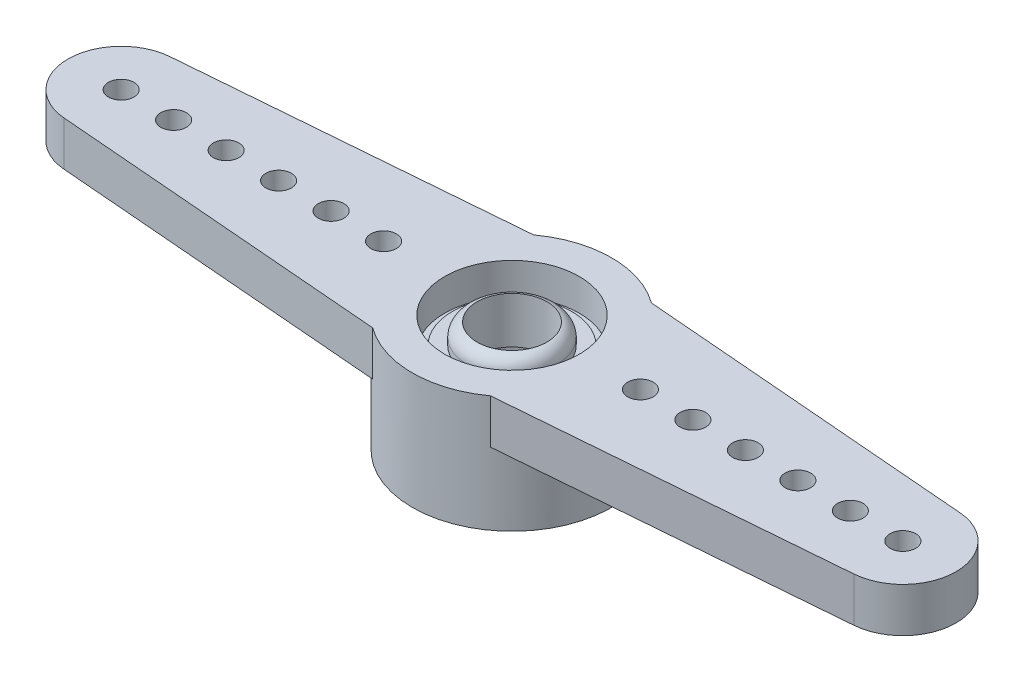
from build123d import *

# Parameters (mm, degrees)
EXTRUDE17_DEPTH = 1.6129
EXTRUDE19_START = -4.2291
SKETCH19_R      = 3.6195
EXTRUDE19_DEPTH = 4.2291
SKETCH20_R      = 0.46355
SKETCH20_R_2    = 1.27
EXTRUDE20_DEPTH = 18.050548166
SKETCH21_R      = 2.44475
EXTRUDE21_DEPTH = 1.1557
SKETCH22_R      = 2.286
EXTRUDE22_DEPTH = 2.3368
SKETCH23_R      = 2.159
EXTRUDE23_DEPTH = 0.2032
SKETCH24_R      = 1.651
EXTRUDE24_DEPTH = 0.762
EXTRUDE25_DEPTH = 0.508
FILLET1_R       = 0.508


with BuildPart() as part:
    # Sketch18 → Extrude17 (new body)
    with BuildSketch(Plane(origin=(0, 0, 0), x_dir=(1, 0, 0), z_dir=(0, 1, 0))):
        with BuildLine():
            Line((-14.34305969, 1.923991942), (-2.13741415, 2.921))
            ThreePointArc((-2.13741415, 2.921), (0, 3.6195), (2.13741415, 2.921))
            Line((2.13741415, 2.921), (14.34305969, 1.923991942))
            ThreePointArc((14.34305969, 1.923991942), (16.1163, 0), (14.34305969, -1.923991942))
            Line((14.34305969, -1.923991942), (2.13741415, -2.921))
            ThreePointArc((2.13741415, -2.921), (0, -3.6195), (-2.13741415, -2.921))
            Line((-2.13741415, -2.921), (-14.34305969, -1.923991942))
            ThreePointArc((-14.34305969, -1.923991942), (-16.1163, 0), (-14.34305969, 1.923991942))
        make_face()
    extrude(amount=EXTRUDE17_DEPTH)

    # Sketch19 → Extrude19 (add)
    with BuildSketch(Plane(origin=(0, 1.6129, 0), x_dir=(1, 0, 0), z_dir=(0, 1, 0)).offset(EXTRUDE19_START)):
        with Locations(Location((0, 0, 0), (0, 0, 126.194447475))):
            Circle(SKETCH19_R)
    extrude(amount=EXTRUDE19_DEPTH)

    # Sketch20 → Extrude20 (cut, through all)
    with BuildSketch(Plane(origin=(0, 1.6129, 0), x_dir=(1, 0, 0), z_dir=(0, 1, 0))):
        with Locations(Location((-14.1859, 0, 0), (0, 0, 270))):
            Circle(SKETCH20_R)
        with Locations(Location((0, 0, 0), (0, 0, 270))):
            Circle(SKETCH20_R_2)
        with Locations(Location((-4.6609, 0, 0), (0, 0, 270))):
            Circle(SKETCH20_R)
        with Locations(Location((-6.5659, 0, 0), (0, 0, 270))):
            Circle(SKETCH20_R)
        with Locations(Location((-8.4709, 0, 0), (0, 0, 270))):
            Circle(SKETCH20_R)
        with Locations(Location((-10.3759, 0, 0), (0, 0, 270))):
            Circle(SKETCH20_R)
        with Locations(Location((-12.2809, 0, 0), (0, 0, 270))):
            Circle(SKETCH20_R)
    extrude20 = extrude(amount=-EXTRUDE20_DEPTH, mode=Mode.SUBTRACT)

    # Sketch21 → Extrude21 (cut)
    with BuildSketch(Plane(origin=(0, 1.6129, 0), x_dir=(1, 0, 0), z_dir=(0, 1, 0))):
        with Locations(Location((0, 0, 0), (0, 0, 270))):
            Circle(SKETCH21_R)
    extrude(amount=-EXTRUDE21_DEPTH, mode=Mode.SUBTRACT)

    # Sketch22 → Extrude22 (cut)
    with BuildSketch(Plane.XZ.offset(2.6162)):
        with Locations(Location((0, 0, 0), (0, 0, 270))):
            Circle(SKETCH22_R)
    extrude(amount=-EXTRUDE22_DEPTH, mode=Mode.SUBTRACT)



with BuildPart() as body_2:
    # Sketch23 → Extrude23 (new body)
    with BuildSketch(Plane(origin=(0, 0.4572, 0), x_dir=(1, 0, 0), z_dir=(0, 1, 0))):
        with Locations(Location((0, 0, 0), (0, 0, 270))):
            Circle(SKETCH23_R)
    extrude(amount=EXTRUDE23_DEPTH)


with BuildPart() as part_1:
    add(part.part)

    add(body_2.part)  # Extrude24 merges body 2
    # Sketch24 → Extrude24 (add)
    with BuildSketch(Plane(origin=(0, 0.6604, 0), x_dir=(1, 0, 0), z_dir=(0, 1, 0))):
        with Locations(Location((0, 0, 0), (0, 0, 90))):
            Circle(SKETCH24_R)
    extrude(amount=EXTRUDE24_DEPTH)

    # Sketch25 → Extrude25 (cut)
    with BuildSketch(Plane(origin=(0, 1.4224, 0), x_dir=(1, 0, 0), z_dir=(0, 1, 0))):
        Polygon((0.254, -1.016), (-0.254, -1.016), (-0.254, -0.254), (-1.016, -0.254), (-1.016, 0.254), (-0.254, 0.254), (-0.254, 1.016), (0.254, 1.016), (0.254, 0.254), (1.016, 0.254), (1.016, -0.254), (0.254, -0.254), align=None)
    extrude(amount=-EXTRUDE25_DEPTH, mode=Mode.SUBTRACT)

    # Fillet1
    fillet1_edges = [part_1.edges().sort_by_distance(p)[0] for p in [
        (0, 1.4224, 1.651),
    ]]
    fillet(fillet1_edges, radius=FILLET1_R)

    # Mirror1: Extrude20 across plane
    add(extrude20.mirror(Plane(origin=(0, 0, 0), x_dir=(0, 0, 1), z_dir=(1, 0, 0))), mode=Mode.SUBTRACT)


solid = part_1.part
